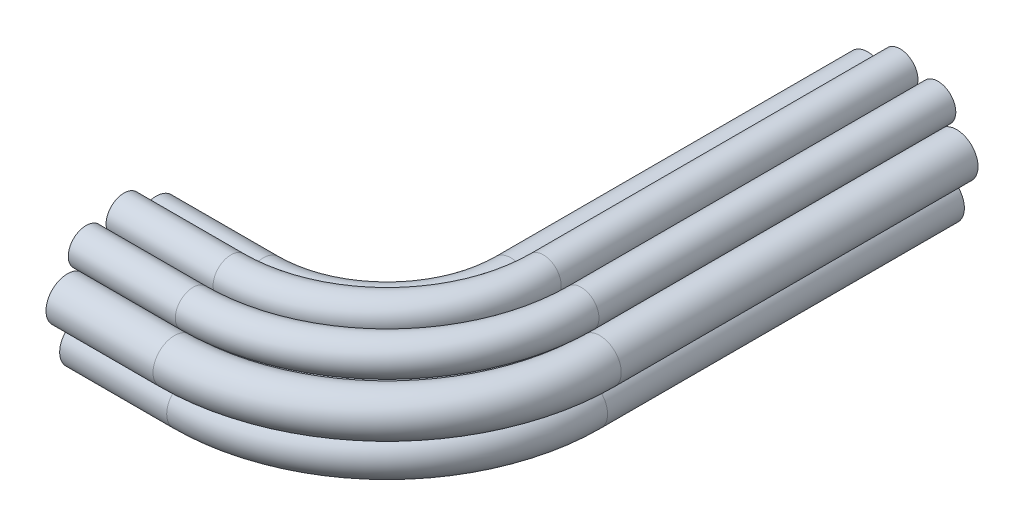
ISO-10303-21;
HEADER;
FILE_DESCRIPTION(('STEP AP214'),'2;1');
FILE_NAME('part.step','',(''),(''),'','','');
FILE_SCHEMA(('AUTOMOTIVE_DESIGN { 1 0 10303 214 1 1 1 1 }'));
ENDSEC;
DATA;
#1=APPLICATION_CONTEXT('core data for automotive mechanical design processes');
#2=APPLICATION_PROTOCOL_DEFINITION('international standard','automotive_design',2000,#1);
#3=PRODUCT_CONTEXT('',#1,'mechanical');
#4=PRODUCT('Part','Part','',(#3));
#5=PRODUCT_RELATED_PRODUCT_CATEGORY('part','',(#4));
#6=PRODUCT_DEFINITION_FORMATION('','',#4);
#7=PRODUCT_DEFINITION_CONTEXT('part definition',#1,'design');
#8=PRODUCT_DEFINITION('design','',#6,#7);
#9=PRODUCT_DEFINITION_SHAPE('','',#8);
#10=(LENGTH_UNIT() NAMED_UNIT(*) SI_UNIT(.MILLI.,.METRE.));
#11=(NAMED_UNIT(*) PLANE_ANGLE_UNIT() SI_UNIT($,.RADIAN.));
#12=(NAMED_UNIT(*) SI_UNIT($,.STERADIAN.) SOLID_ANGLE_UNIT());
#13=UNCERTAINTY_MEASURE_WITH_UNIT(LENGTH_MEASURE(1.E-05),#10,'distance_accuracy_value','');
#14=(GEOMETRIC_REPRESENTATION_CONTEXT(3) GLOBAL_UNCERTAINTY_ASSIGNED_CONTEXT((#13)) GLOBAL_UNIT_ASSIGNED_CONTEXT((#10,
#11,#12)) REPRESENTATION_CONTEXT('',''));
#15=CARTESIAN_POINT('',(0.,0.,0.));
#16=DIRECTION('',(0.,0.,1.));
#17=DIRECTION('',(1.,0.,0.));
#18=AXIS2_PLACEMENT_3D('',#15,#16,#17);
#19=CARTESIAN_POINT('',(-35.,2.56981819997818,159.613254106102));
#20=DIRECTION('',(-1.,0.,0.));
#21=DIRECTION('',(0.,0.,1.));
#22=AXIS2_PLACEMENT_3D('',#19,#20,#21);
#23=CYLINDRICAL_SURFACE('',#22,6.);
#24=CARTESIAN_POINT('',(-35.,2.56981819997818,159.613254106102));
#25=DIRECTION('',(1.,0.,0.));
#26=DIRECTION('',(0.,0.,-1.));
#27=AXIS2_PLACEMENT_3D('',#24,#25,#26);
#28=CIRCLE('',#27,6.);
#29=CARTESIAN_POINT('',(-35.,2.56981819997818,165.613254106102));
#30=VERTEX_POINT('',#29);
#31=EDGE_CURVE('P0_E20',#30,#30,#28,.T.);
#32=ORIENTED_EDGE('',*,*,#31,.F.);
#33=EDGE_LOOP('',(#32));
#34=FACE_BOUND('',#33,.T.);
#35=CARTESIAN_POINT('',(-65.,2.56981819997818,159.613254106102));
#36=DIRECTION('',(1.,0.,0.));
#37=DIRECTION('',(0.,0.,-1.));
#38=AXIS2_PLACEMENT_3D('',#35,#36,#37);
#39=CIRCLE('',#38,6.);
#40=CARTESIAN_POINT('',(-65.,2.56981819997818,153.613254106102));
#41=VERTEX_POINT('',#40);
#42=EDGE_CURVE('P0_E10',#41,#41,#39,.T.);
#43=ORIENTED_EDGE('',*,*,#42,.T.);
#44=EDGE_LOOP('',(#43));
#45=FACE_BOUND('',#44,.T.);
#46=ADVANCED_FACE('P0_F14',(#34,#45),#23,.T.);
#47=CARTESIAN_POINT('',(-35.,2.56981819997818,100.));
#48=DIRECTION('',(0.,-1.,0.));
#49=DIRECTION('',(0.,0.,-1.));
#50=AXIS2_PLACEMENT_3D('',#47,#48,#49);
#51=TOROIDAL_SURFACE('',#50,59.6132541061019,6.);
#52=CARTESIAN_POINT('',(24.6132541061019,2.56981819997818,100.));
#53=DIRECTION('',(0.,0.,-1.));
#54=DIRECTION('',(-1.,0.,0.));
#55=AXIS2_PLACEMENT_3D('',#52,#53,#54);
#56=CIRCLE('',#55,6.);
#57=CARTESIAN_POINT('',(30.6132541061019,2.56981819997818,100.));
#58=VERTEX_POINT('',#57);
#59=EDGE_CURVE('P0_E24',#58,#58,#56,.T.);
#60=CARTESIAN_POINT('',(-35.,2.56981819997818,100.));
#61=DIRECTION('',(0.,-1.,0.));
#62=DIRECTION('',(0.,0.,-1.));
#63=AXIS2_PLACEMENT_3D('',#60,#61,#62);
#64=CIRCLE('',#63,65.6132541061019);
#65=EDGE_CURVE('',#58,#30,#64,.T.);
#66=ORIENTED_EDGE('',*,*,#59,.F.);
#67=ORIENTED_EDGE('',*,*,#31,.T.);
#68=ORIENTED_EDGE('',*,*,#65,.T.);
#69=ORIENTED_EDGE('',*,*,#65,.F.);
#70=EDGE_LOOP('',(#66,#68,#67,#69));
#71=FACE_BOUND('',#70,.T.);
#72=ADVANCED_FACE('P0_F39',(#71),#51,.T.);
#73=CARTESIAN_POINT('',(24.6132541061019,2.56981819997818,100.));
#74=DIRECTION('',(0.,0.,-1.));
#75=DIRECTION('',(-1.,0.,0.));
#76=AXIS2_PLACEMENT_3D('',#73,#74,#75);
#77=CYLINDRICAL_SURFACE('',#76,6.);
#78=ORIENTED_EDGE('',*,*,#59,.T.);
#79=EDGE_LOOP('',(#78));
#80=FACE_BOUND('',#79,.T.);
#81=CARTESIAN_POINT('',(24.6132541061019,2.56981819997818,0.));
#82=DIRECTION('',(0.,0.,-1.));
#83=DIRECTION('',(-1.,0.,0.));
#84=AXIS2_PLACEMENT_3D('',#81,#82,#83);
#85=CIRCLE('',#84,6.);
#86=CARTESIAN_POINT('',(18.6132541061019,2.56981819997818,0.));
#87=VERTEX_POINT('',#86);
#88=EDGE_CURVE('P0_E28',#87,#87,#85,.T.);
#89=ORIENTED_EDGE('',*,*,#88,.F.);
#90=EDGE_LOOP('',(#89));
#91=FACE_BOUND('',#90,.T.);
#92=ADVANCED_FACE('P0_F36',(#80,#91),#77,.T.);
#93=CARTESIAN_POINT('',(-65.,2.56981819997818,159.613254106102));
#94=DIRECTION('',(1.,0.,0.));
#95=DIRECTION('',(0.,0.,-1.));
#96=AXIS2_PLACEMENT_3D('',#93,#94,#95);
#97=PLANE('',#96);
#98=ORIENTED_EDGE('',*,*,#42,.F.);
#99=EDGE_LOOP('',(#98));
#100=FACE_BOUND('',#99,.T.);
#101=ADVANCED_FACE('P0_F38',(#100),#97,.F.);
#102=CARTESIAN_POINT('',(24.6132541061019,2.56981819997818,0.));
#103=DIRECTION('',(0.,0.,-1.));
#104=DIRECTION('',(-1.,0.,0.));
#105=AXIS2_PLACEMENT_3D('',#102,#103,#104);
#106=PLANE('',#105);
#107=ORIENTED_EDGE('',*,*,#88,.T.);
#108=EDGE_LOOP('',(#107));
#109=FACE_BOUND('',#108,.T.);
#110=ADVANCED_FACE('P0_F34',(#109),#106,.T.);
#111=CLOSED_SHELL('',(#46,#72,#92,#101,#110));
#112=MANIFOLD_SOLID_BREP('P0_B1',#111);
#113=CARTESIAN_POINT('',(-35.,0.,127.508594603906));
#114=DIRECTION('',(-1.,0.,0.));
#115=DIRECTION('',(0.,0.,1.));
#116=AXIS2_PLACEMENT_3D('',#113,#114,#115);
#117=CYLINDRICAL_SURFACE('',#116,5.);
#118=CARTESIAN_POINT('',(-35.,0.,127.508594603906));
#119=DIRECTION('',(1.,0.,0.));
#120=DIRECTION('',(0.,0.,-1.));
#121=AXIS2_PLACEMENT_3D('',#118,#119,#120);
#122=CIRCLE('',#121,5.);
#123=CARTESIAN_POINT('',(-35.,0.,132.508594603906));
#124=VERTEX_POINT('',#123);
#125=EDGE_CURVE('P1_E20',#124,#124,#122,.T.);
#126=ORIENTED_EDGE('',*,*,#125,.F.);
#127=EDGE_LOOP('',(#126));
#128=FACE_BOUND('',#127,.T.);
#129=CARTESIAN_POINT('',(-65.,0.,127.508594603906));
#130=DIRECTION('',(1.,0.,0.));
#131=DIRECTION('',(0.,0.,-1.));
#132=AXIS2_PLACEMENT_3D('',#129,#130,#131);
#133=CIRCLE('',#132,5.);
#134=CARTESIAN_POINT('',(-65.,0.,122.508594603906));
#135=VERTEX_POINT('',#134);
#136=EDGE_CURVE('P1_E10',#135,#135,#133,.T.);
#137=ORIENTED_EDGE('',*,*,#136,.T.);
#138=EDGE_LOOP('',(#137));
#139=FACE_BOUND('',#138,.T.);
#140=ADVANCED_FACE('P1_F14',(#128,#139),#117,.T.);
#141=CARTESIAN_POINT('',(-35.,0.,100.));
#142=DIRECTION('',(0.,-1.,0.));
#143=DIRECTION('',(0.,0.,-1.));
#144=AXIS2_PLACEMENT_3D('',#141,#142,#143);
#145=TOROIDAL_SURFACE('',#144,27.5085946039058,5.);
#146=CARTESIAN_POINT('',(-7.49140539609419,0.,100.));
#147=DIRECTION('',(0.,0.,-1.));
#148=DIRECTION('',(-1.,0.,0.));
#149=AXIS2_PLACEMENT_3D('',#146,#147,#148);
#150=CIRCLE('',#149,5.);
#151=CARTESIAN_POINT('',(-2.49140539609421,0.,100.));
#152=VERTEX_POINT('',#151);
#153=EDGE_CURVE('P1_E24',#152,#152,#150,.T.);
#154=CARTESIAN_POINT('',(-35.,0.,100.));
#155=DIRECTION('',(0.,-1.,0.));
#156=DIRECTION('',(0.,0.,-1.));
#157=AXIS2_PLACEMENT_3D('',#154,#155,#156);
#158=CIRCLE('',#157,32.5085946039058);
#159=EDGE_CURVE('',#152,#124,#158,.T.);
#160=ORIENTED_EDGE('',*,*,#153,.F.);
#161=ORIENTED_EDGE('',*,*,#125,.T.);
#162=ORIENTED_EDGE('',*,*,#159,.T.);
#163=ORIENTED_EDGE('',*,*,#159,.F.);
#164=EDGE_LOOP('',(#160,#162,#161,#163));
#165=FACE_BOUND('',#164,.T.);
#166=ADVANCED_FACE('P1_F39',(#165),#145,.T.);
#167=CARTESIAN_POINT('',(-7.49140539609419,0.,100.));
#168=DIRECTION('',(0.,0.,-1.));
#169=DIRECTION('',(-1.,0.,0.));
#170=AXIS2_PLACEMENT_3D('',#167,#168,#169);
#171=CYLINDRICAL_SURFACE('',#170,5.);
#172=ORIENTED_EDGE('',*,*,#153,.T.);
#173=EDGE_LOOP('',(#172));
#174=FACE_BOUND('',#173,.T.);
#175=CARTESIAN_POINT('',(-7.49140539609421,0.,0.));
#176=DIRECTION('',(0.,0.,-1.));
#177=DIRECTION('',(-1.,0.,0.));
#178=AXIS2_PLACEMENT_3D('',#175,#176,#177);
#179=CIRCLE('',#178,5.);
#180=CARTESIAN_POINT('',(-12.4914053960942,0.,0.));
#181=VERTEX_POINT('',#180);
#182=EDGE_CURVE('P1_E28',#181,#181,#179,.T.);
#183=ORIENTED_EDGE('',*,*,#182,.F.);
#184=EDGE_LOOP('',(#183));
#185=FACE_BOUND('',#184,.T.);
#186=ADVANCED_FACE('P1_F36',(#174,#185),#171,.T.);
#187=CARTESIAN_POINT('',(-65.,0.,127.508594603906));
#188=DIRECTION('',(1.,0.,0.));
#189=DIRECTION('',(0.,0.,-1.));
#190=AXIS2_PLACEMENT_3D('',#187,#188,#189);
#191=PLANE('',#190);
#192=ORIENTED_EDGE('',*,*,#136,.F.);
#193=EDGE_LOOP('',(#192));
#194=FACE_BOUND('',#193,.T.);
#195=ADVANCED_FACE('P1_F38',(#194),#191,.F.);
#196=CARTESIAN_POINT('',(-7.49140539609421,0.,0.));
#197=DIRECTION('',(0.,0.,-1.));
#198=DIRECTION('',(-1.,0.,0.));
#199=AXIS2_PLACEMENT_3D('',#196,#197,#198);
#200=PLANE('',#199);
#201=ORIENTED_EDGE('',*,*,#182,.T.);
#202=EDGE_LOOP('',(#201));
#203=FACE_BOUND('',#202,.T.);
#204=ADVANCED_FACE('P1_F34',(#203),#200,.T.);
#205=CLOSED_SHELL('',(#140,#166,#186,#195,#204));
#206=MANIFOLD_SOLID_BREP('P1_B1',#205);
#207=CARTESIAN_POINT('',(-35.,8.97665881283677,134.733603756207));
#208=DIRECTION('',(-1.,0.,0.));
#209=DIRECTION('',(0.,0.,1.));
#210=AXIS2_PLACEMENT_3D('',#207,#208,#209);
#211=CYLINDRICAL_SURFACE('',#210,6.);
#212=CARTESIAN_POINT('',(-35.,8.97665881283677,134.733603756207));
#213=DIRECTION('',(1.,0.,0.));
#214=DIRECTION('',(0.,0.,-1.));
#215=AXIS2_PLACEMENT_3D('',#212,#213,#214);
#216=CIRCLE('',#215,6.);
#217=CARTESIAN_POINT('',(-35.,8.97665881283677,140.733603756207));
#218=VERTEX_POINT('',#217);
#219=EDGE_CURVE('P2_E20',#218,#218,#216,.T.);
#220=ORIENTED_EDGE('',*,*,#219,.F.);
#221=EDGE_LOOP('',(#220));
#222=FACE_BOUND('',#221,.T.);
#223=CARTESIAN_POINT('',(-65.,8.97665881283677,134.733603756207));
#224=DIRECTION('',(1.,0.,0.));
#225=DIRECTION('',(0.,0.,-1.));
#226=AXIS2_PLACEMENT_3D('',#223,#224,#225);
#227=CIRCLE('',#226,6.);
#228=CARTESIAN_POINT('',(-65.,8.97665881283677,128.733603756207));
#229=VERTEX_POINT('',#228);
#230=EDGE_CURVE('P2_E10',#229,#229,#227,.T.);
#231=ORIENTED_EDGE('',*,*,#230,.T.);
#232=EDGE_LOOP('',(#231));
#233=FACE_BOUND('',#232,.T.);
#234=ADVANCED_FACE('P2_F14',(#222,#233),#211,.T.);
#235=CARTESIAN_POINT('',(-35.,8.97665881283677,100.));
#236=DIRECTION('',(0.,-1.,0.));
#237=DIRECTION('',(0.,0.,-1.));
#238=AXIS2_PLACEMENT_3D('',#235,#236,#237);
#239=TOROIDAL_SURFACE('',#238,34.7336037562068,6.);
#240=CARTESIAN_POINT('',(-0.266396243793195,8.97665881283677,100.));
#241=DIRECTION('',(0.,0.,-1.));
#242=DIRECTION('',(-1.,0.,0.));
#243=AXIS2_PLACEMENT_3D('',#240,#241,#242);
#244=CIRCLE('',#243,6.);
#245=CARTESIAN_POINT('',(5.7336037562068,8.97665881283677,100.));
#246=VERTEX_POINT('',#245);
#247=EDGE_CURVE('P2_E24',#246,#246,#244,.T.);
#248=CARTESIAN_POINT('',(-35.,8.97665881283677,100.));
#249=DIRECTION('',(0.,-1.,0.));
#250=DIRECTION('',(0.,0.,-1.));
#251=AXIS2_PLACEMENT_3D('',#248,#249,#250);
#252=CIRCLE('',#251,40.7336037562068);
#253=EDGE_CURVE('',#246,#218,#252,.T.);
#254=ORIENTED_EDGE('',*,*,#247,.F.);
#255=ORIENTED_EDGE('',*,*,#219,.T.);
#256=ORIENTED_EDGE('',*,*,#253,.T.);
#257=ORIENTED_EDGE('',*,*,#253,.F.);
#258=EDGE_LOOP('',(#254,#256,#255,#257));
#259=FACE_BOUND('',#258,.T.);
#260=ADVANCED_FACE('P2_F39',(#259),#239,.T.);
#261=CARTESIAN_POINT('',(-0.266396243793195,8.97665881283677,100.));
#262=DIRECTION('',(0.,0.,-1.));
#263=DIRECTION('',(-1.,0.,0.));
#264=AXIS2_PLACEMENT_3D('',#261,#262,#263);
#265=CYLINDRICAL_SURFACE('',#264,6.);
#266=ORIENTED_EDGE('',*,*,#247,.T.);
#267=EDGE_LOOP('',(#266));
#268=FACE_BOUND('',#267,.T.);
#269=CARTESIAN_POINT('',(-0.266396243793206,8.97665881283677,0.));
#270=DIRECTION('',(0.,0.,-1.));
#271=DIRECTION('',(-1.,0.,0.));
#272=AXIS2_PLACEMENT_3D('',#269,#270,#271);
#273=CIRCLE('',#272,6.);
#274=CARTESIAN_POINT('',(-6.26639624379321,8.97665881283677,0.));
#275=VERTEX_POINT('',#274);
#276=EDGE_CURVE('P2_E28',#275,#275,#273,.T.);
#277=ORIENTED_EDGE('',*,*,#276,.F.);
#278=EDGE_LOOP('',(#277));
#279=FACE_BOUND('',#278,.T.);
#280=ADVANCED_FACE('P2_F36',(#268,#279),#265,.T.);
#281=CARTESIAN_POINT('',(-65.,8.97665881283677,134.733603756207));
#282=DIRECTION('',(1.,0.,0.));
#283=DIRECTION('',(0.,0.,-1.));
#284=AXIS2_PLACEMENT_3D('',#281,#282,#283);
#285=PLANE('',#284);
#286=ORIENTED_EDGE('',*,*,#230,.F.);
#287=EDGE_LOOP('',(#286));
#288=FACE_BOUND('',#287,.T.);
#289=ADVANCED_FACE('P2_F38',(#288),#285,.F.);
#290=CARTESIAN_POINT('',(-0.266396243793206,8.97665881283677,0.));
#291=DIRECTION('',(0.,0.,-1.));
#292=DIRECTION('',(-1.,0.,0.));
#293=AXIS2_PLACEMENT_3D('',#290,#291,#292);
#294=PLANE('',#293);
#295=ORIENTED_EDGE('',*,*,#276,.T.);
#296=EDGE_LOOP('',(#295));
#297=FACE_BOUND('',#296,.T.);
#298=ADVANCED_FACE('P2_F34',(#297),#294,.T.);
#299=CLOSED_SHELL('',(#234,#260,#280,#289,#298));
#300=MANIFOLD_SOLID_BREP('P2_B1',#299);
#301=CARTESIAN_POINT('',(-35.,-9.41560890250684,135.785203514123));
#302=DIRECTION('',(-1.,0.,0.));
#303=DIRECTION('',(0.,0.,1.));
#304=AXIS2_PLACEMENT_3D('',#301,#302,#303);
#305=CYLINDRICAL_SURFACE('',#304,6.);
#306=CARTESIAN_POINT('',(-35.,-9.41560890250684,135.785203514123));
#307=DIRECTION('',(1.,0.,0.));
#308=DIRECTION('',(0.,0.,-1.));
#309=AXIS2_PLACEMENT_3D('',#306,#307,#308);
#310=CIRCLE('',#309,6.);
#311=CARTESIAN_POINT('',(-35.,-9.41560890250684,141.785203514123));
#312=VERTEX_POINT('',#311);
#313=EDGE_CURVE('P3_E20',#312,#312,#310,.T.);
#314=ORIENTED_EDGE('',*,*,#313,.F.);
#315=EDGE_LOOP('',(#314));
#316=FACE_BOUND('',#315,.T.);
#317=CARTESIAN_POINT('',(-65.,-9.41560890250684,135.785203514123));
#318=DIRECTION('',(1.,0.,0.));
#319=DIRECTION('',(0.,0.,-1.));
#320=AXIS2_PLACEMENT_3D('',#317,#318,#319);
#321=CIRCLE('',#320,6.);
#322=CARTESIAN_POINT('',(-65.,-9.41560890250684,129.785203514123));
#323=VERTEX_POINT('',#322);
#324=EDGE_CURVE('P3_E10',#323,#323,#321,.T.);
#325=ORIENTED_EDGE('',*,*,#324,.T.);
#326=EDGE_LOOP('',(#325));
#327=FACE_BOUND('',#326,.T.);
#328=ADVANCED_FACE('P3_F14',(#316,#327),#305,.T.);
#329=CARTESIAN_POINT('',(-35.,-9.41560890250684,100.));
#330=DIRECTION('',(0.,-1.,0.));
#331=DIRECTION('',(0.,0.,-1.));
#332=AXIS2_PLACEMENT_3D('',#329,#330,#331);
#333=TOROIDAL_SURFACE('',#332,35.7852035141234,6.);
#334=CARTESIAN_POINT('',(0.785203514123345,-9.41560890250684,100.));
#335=DIRECTION('',(0.,0.,-1.));
#336=DIRECTION('',(-1.,0.,0.));
#337=AXIS2_PLACEMENT_3D('',#334,#335,#336);
#338=CIRCLE('',#337,6.);
#339=CARTESIAN_POINT('',(6.78520351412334,-9.41560890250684,100.));
#340=VERTEX_POINT('',#339);
#341=EDGE_CURVE('P3_E24',#340,#340,#338,.T.);
#342=CARTESIAN_POINT('',(-35.,-9.41560890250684,100.));
#343=DIRECTION('',(0.,-1.,0.));
#344=DIRECTION('',(0.,0.,-1.));
#345=AXIS2_PLACEMENT_3D('',#342,#343,#344);
#346=CIRCLE('',#345,41.7852035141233);
#347=EDGE_CURVE('',#340,#312,#346,.T.);
#348=ORIENTED_EDGE('',*,*,#341,.F.);
#349=ORIENTED_EDGE('',*,*,#313,.T.);
#350=ORIENTED_EDGE('',*,*,#347,.T.);
#351=ORIENTED_EDGE('',*,*,#347,.F.);
#352=EDGE_LOOP('',(#348,#350,#349,#351));
#353=FACE_BOUND('',#352,.T.);
#354=ADVANCED_FACE('P3_F39',(#353),#333,.T.);
#355=CARTESIAN_POINT('',(0.785203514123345,-9.41560890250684,100.));
#356=DIRECTION('',(0.,0.,-1.));
#357=DIRECTION('',(-1.,0.,0.));
#358=AXIS2_PLACEMENT_3D('',#355,#356,#357);
#359=CYLINDRICAL_SURFACE('',#358,6.);
#360=ORIENTED_EDGE('',*,*,#341,.T.);
#361=EDGE_LOOP('',(#360));
#362=FACE_BOUND('',#361,.T.);
#363=CARTESIAN_POINT('',(0.785203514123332,-9.41560890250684,0.));
#364=DIRECTION('',(0.,0.,-1.));
#365=DIRECTION('',(-1.,0.,0.));
#366=AXIS2_PLACEMENT_3D('',#363,#364,#365);
#367=CIRCLE('',#366,6.);
#368=CARTESIAN_POINT('',(-5.21479648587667,-9.41560890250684,0.));
#369=VERTEX_POINT('',#368);
#370=EDGE_CURVE('P3_E28',#369,#369,#367,.T.);
#371=ORIENTED_EDGE('',*,*,#370,.F.);
#372=EDGE_LOOP('',(#371));
#373=FACE_BOUND('',#372,.T.);
#374=ADVANCED_FACE('P3_F36',(#362,#373),#359,.T.);
#375=CARTESIAN_POINT('',(-65.,-9.41560890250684,135.785203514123));
#376=DIRECTION('',(1.,0.,0.));
#377=DIRECTION('',(0.,0.,-1.));
#378=AXIS2_PLACEMENT_3D('',#375,#376,#377);
#379=PLANE('',#378);
#380=ORIENTED_EDGE('',*,*,#324,.F.);
#381=EDGE_LOOP('',(#380));
#382=FACE_BOUND('',#381,.T.);
#383=ADVANCED_FACE('P3_F38',(#382),#379,.F.);
#384=CARTESIAN_POINT('',(0.785203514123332,-9.41560890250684,0.));
#385=DIRECTION('',(0.,0.,-1.));
#386=DIRECTION('',(-1.,0.,0.));
#387=AXIS2_PLACEMENT_3D('',#384,#385,#386);
#388=PLANE('',#387);
#389=ORIENTED_EDGE('',*,*,#370,.T.);
#390=EDGE_LOOP('',(#389));
#391=FACE_BOUND('',#390,.T.);
#392=ADVANCED_FACE('P3_F34',(#391),#388,.T.);
#393=CLOSED_SHELL('',(#328,#354,#374,#383,#392));
#394=MANIFOLD_SOLID_BREP('P3_B1',#393);
#395=CARTESIAN_POINT('',(-35.,-9.41560890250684,155.785203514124));
#396=DIRECTION('',(-1.,0.,0.));
#397=DIRECTION('',(0.,0.,1.));
#398=AXIS2_PLACEMENT_3D('',#395,#396,#397);
#399=CYLINDRICAL_SURFACE('',#398,6.);
#400=CARTESIAN_POINT('',(-35.,-9.41560890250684,155.785203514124));
#401=DIRECTION('',(1.,0.,0.));
#402=DIRECTION('',(0.,0.,-1.));
#403=AXIS2_PLACEMENT_3D('',#400,#401,#402);
#404=CIRCLE('',#403,6.);
#405=CARTESIAN_POINT('',(-35.,-9.41560890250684,161.785203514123));
#406=VERTEX_POINT('',#405);
#407=EDGE_CURVE('P4_E20',#406,#406,#404,.T.);
#408=ORIENTED_EDGE('',*,*,#407,.F.);
#409=EDGE_LOOP('',(#408));
#410=FACE_BOUND('',#409,.T.);
#411=CARTESIAN_POINT('',(-65.,-9.41560890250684,155.785203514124));
#412=DIRECTION('',(1.,0.,0.));
#413=DIRECTION('',(0.,0.,-1.));
#414=AXIS2_PLACEMENT_3D('',#411,#412,#413);
#415=CIRCLE('',#414,6.);
#416=CARTESIAN_POINT('',(-65.,-9.41560890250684,149.785203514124));
#417=VERTEX_POINT('',#416);
#418=EDGE_CURVE('P4_E10',#417,#417,#415,.T.);
#419=ORIENTED_EDGE('',*,*,#418,.T.);
#420=EDGE_LOOP('',(#419));
#421=FACE_BOUND('',#420,.T.);
#422=ADVANCED_FACE('P4_F14',(#410,#421),#399,.T.);
#423=CARTESIAN_POINT('',(-35.,-9.41560890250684,100.));
#424=DIRECTION('',(0.,-1.,0.));
#425=DIRECTION('',(0.,0.,-1.));
#426=AXIS2_PLACEMENT_3D('',#423,#424,#425);
#427=TOROIDAL_SURFACE('',#426,55.7852035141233,6.);
#428=CARTESIAN_POINT('',(20.7852035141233,-9.41560890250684,100.));
#429=DIRECTION('',(0.,0.,-1.));
#430=DIRECTION('',(-1.,0.,0.));
#431=AXIS2_PLACEMENT_3D('',#428,#429,#430);
#432=CIRCLE('',#431,6.);
#433=CARTESIAN_POINT('',(26.7852035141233,-9.41560890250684,100.));
#434=VERTEX_POINT('',#433);
#435=EDGE_CURVE('P4_E24',#434,#434,#432,.T.);
#436=CARTESIAN_POINT('',(-35.,-9.41560890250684,100.));
#437=DIRECTION('',(0.,-1.,0.));
#438=DIRECTION('',(0.,0.,-1.));
#439=AXIS2_PLACEMENT_3D('',#436,#437,#438);
#440=CIRCLE('',#439,61.7852035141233);
#441=EDGE_CURVE('',#434,#406,#440,.T.);
#442=ORIENTED_EDGE('',*,*,#435,.F.);
#443=ORIENTED_EDGE('',*,*,#407,.T.);
#444=ORIENTED_EDGE('',*,*,#441,.T.);
#445=ORIENTED_EDGE('',*,*,#441,.F.);
#446=EDGE_LOOP('',(#442,#444,#443,#445));
#447=FACE_BOUND('',#446,.T.);
#448=ADVANCED_FACE('P4_F39',(#447),#427,.T.);
#449=CARTESIAN_POINT('',(20.7852035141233,-9.41560890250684,100.));
#450=DIRECTION('',(0.,0.,-1.));
#451=DIRECTION('',(-1.,0.,0.));
#452=AXIS2_PLACEMENT_3D('',#449,#450,#451);
#453=CYLINDRICAL_SURFACE('',#452,6.);
#454=ORIENTED_EDGE('',*,*,#435,.T.);
#455=EDGE_LOOP('',(#454));
#456=FACE_BOUND('',#455,.T.);
#457=CARTESIAN_POINT('',(20.7852035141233,-9.41560890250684,0.));
#458=DIRECTION('',(0.,0.,-1.));
#459=DIRECTION('',(-1.,0.,0.));
#460=AXIS2_PLACEMENT_3D('',#457,#458,#459);
#461=CIRCLE('',#460,6.);
#462=CARTESIAN_POINT('',(14.7852035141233,-9.41560890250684,0.));
#463=VERTEX_POINT('',#462);
#464=EDGE_CURVE('P4_E28',#463,#463,#461,.T.);
#465=ORIENTED_EDGE('',*,*,#464,.F.);
#466=EDGE_LOOP('',(#465));
#467=FACE_BOUND('',#466,.T.);
#468=ADVANCED_FACE('P4_F36',(#456,#467),#453,.T.);
#469=CARTESIAN_POINT('',(-65.,-9.41560890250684,155.785203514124));
#470=DIRECTION('',(1.,0.,0.));
#471=DIRECTION('',(0.,0.,-1.));
#472=AXIS2_PLACEMENT_3D('',#469,#470,#471);
#473=PLANE('',#472);
#474=ORIENTED_EDGE('',*,*,#418,.F.);
#475=EDGE_LOOP('',(#474));
#476=FACE_BOUND('',#475,.T.);
#477=ADVANCED_FACE('P4_F38',(#476),#473,.F.);
#478=CARTESIAN_POINT('',(20.7852035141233,-9.41560890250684,0.));
#479=DIRECTION('',(0.,0.,-1.));
#480=DIRECTION('',(-1.,0.,0.));
#481=AXIS2_PLACEMENT_3D('',#478,#479,#480);
#482=PLANE('',#481);
#483=ORIENTED_EDGE('',*,*,#464,.T.);
#484=EDGE_LOOP('',(#483));
#485=FACE_BOUND('',#484,.T.);
#486=ADVANCED_FACE('P4_F34',(#485),#482,.T.);
#487=CLOSED_SHELL('',(#422,#448,#468,#477,#486));
#488=MANIFOLD_SOLID_BREP('P4_B1',#487);
#489=CARTESIAN_POINT('',(-35.,15.2473457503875,143.77724350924));
#490=DIRECTION('',(-1.,0.,0.));
#491=DIRECTION('',(0.,0.,1.));
#492=AXIS2_PLACEMENT_3D('',#489,#490,#491);
#493=CYLINDRICAL_SURFACE('',#492,5.);
#494=CARTESIAN_POINT('',(-35.,15.2473457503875,143.77724350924));
#495=DIRECTION('',(1.,0.,0.));
#496=DIRECTION('',(0.,0.,-1.));
#497=AXIS2_PLACEMENT_3D('',#494,#495,#496);
#498=CIRCLE('',#497,5.);
#499=CARTESIAN_POINT('',(-35.,15.2473457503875,148.77724350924));
#500=VERTEX_POINT('',#499);
#501=EDGE_CURVE('P5_E20',#500,#500,#498,.T.);
#502=ORIENTED_EDGE('',*,*,#501,.F.);
#503=EDGE_LOOP('',(#502));
#504=FACE_BOUND('',#503,.T.);
#505=CARTESIAN_POINT('',(-65.,15.2473457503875,143.77724350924));
#506=DIRECTION('',(1.,0.,0.));
#507=DIRECTION('',(0.,0.,-1.));
#508=AXIS2_PLACEMENT_3D('',#505,#506,#507);
#509=CIRCLE('',#508,5.);
#510=CARTESIAN_POINT('',(-65.,15.2473457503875,138.77724350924));
#511=VERTEX_POINT('',#510);
#512=EDGE_CURVE('P5_E10',#511,#511,#509,.T.);
#513=ORIENTED_EDGE('',*,*,#512,.T.);
#514=EDGE_LOOP('',(#513));
#515=FACE_BOUND('',#514,.T.);
#516=ADVANCED_FACE('P5_F14',(#504,#515),#493,.T.);
#517=CARTESIAN_POINT('',(-35.,15.2473457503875,100.));
#518=DIRECTION('',(0.,-1.,0.));
#519=DIRECTION('',(0.,0.,-1.));
#520=AXIS2_PLACEMENT_3D('',#517,#518,#519);
#521=TOROIDAL_SURFACE('',#520,43.7772435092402,5.);
#522=CARTESIAN_POINT('',(8.77724350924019,15.2473457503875,100.));
#523=DIRECTION('',(0.,0.,-1.));
#524=DIRECTION('',(-1.,0.,0.));
#525=AXIS2_PLACEMENT_3D('',#522,#523,#524);
#526=CIRCLE('',#525,5.);
#527=CARTESIAN_POINT('',(13.7772435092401,15.2473457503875,100.));
#528=VERTEX_POINT('',#527);
#529=EDGE_CURVE('P5_E24',#528,#528,#526,.T.);
#530=CARTESIAN_POINT('',(-35.,15.2473457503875,100.));
#531=DIRECTION('',(0.,-1.,0.));
#532=DIRECTION('',(0.,0.,-1.));
#533=AXIS2_PLACEMENT_3D('',#530,#531,#532);
#534=CIRCLE('',#533,48.7772435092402);
#535=EDGE_CURVE('',#528,#500,#534,.T.);
#536=ORIENTED_EDGE('',*,*,#529,.F.);
#537=ORIENTED_EDGE('',*,*,#501,.T.);
#538=ORIENTED_EDGE('',*,*,#535,.T.);
#539=ORIENTED_EDGE('',*,*,#535,.F.);
#540=EDGE_LOOP('',(#536,#538,#537,#539));
#541=FACE_BOUND('',#540,.T.);
#542=ADVANCED_FACE('P5_F39',(#541),#521,.T.);
#543=CARTESIAN_POINT('',(8.77724350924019,15.2473457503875,100.));
#544=DIRECTION('',(0.,0.,-1.));
#545=DIRECTION('',(-1.,0.,0.));
#546=AXIS2_PLACEMENT_3D('',#543,#544,#545);
#547=CYLINDRICAL_SURFACE('',#546,5.);
#548=ORIENTED_EDGE('',*,*,#529,.T.);
#549=EDGE_LOOP('',(#548));
#550=FACE_BOUND('',#549,.T.);
#551=CARTESIAN_POINT('',(8.77724350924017,15.2473457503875,0.));
#552=DIRECTION('',(0.,0.,-1.));
#553=DIRECTION('',(-1.,0.,0.));
#554=AXIS2_PLACEMENT_3D('',#551,#552,#553);
#555=CIRCLE('',#554,5.);
#556=CARTESIAN_POINT('',(3.77724350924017,15.2473457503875,0.));
#557=VERTEX_POINT('',#556);
#558=EDGE_CURVE('P5_E28',#557,#557,#555,.T.);
#559=ORIENTED_EDGE('',*,*,#558,.F.);
#560=EDGE_LOOP('',(#559));
#561=FACE_BOUND('',#560,.T.);
#562=ADVANCED_FACE('P5_F36',(#550,#561),#547,.T.);
#563=CARTESIAN_POINT('',(-65.,15.2473457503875,143.77724350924));
#564=DIRECTION('',(1.,0.,0.));
#565=DIRECTION('',(0.,0.,-1.));
#566=AXIS2_PLACEMENT_3D('',#563,#564,#565);
#567=PLANE('',#566);
#568=ORIENTED_EDGE('',*,*,#512,.F.);
#569=EDGE_LOOP('',(#568));
#570=FACE_BOUND('',#569,.T.);
#571=ADVANCED_FACE('P5_F38',(#570),#567,.F.);
#572=CARTESIAN_POINT('',(8.77724350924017,15.2473457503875,0.));
#573=DIRECTION('',(0.,0.,-1.));
#574=DIRECTION('',(-1.,0.,0.));
#575=AXIS2_PLACEMENT_3D('',#572,#573,#574);
#576=PLANE('',#575);
#577=ORIENTED_EDGE('',*,*,#558,.T.);
#578=EDGE_LOOP('',(#577));
#579=FACE_BOUND('',#578,.T.);
#580=ADVANCED_FACE('P5_F34',(#579),#576,.T.);
#581=CLOSED_SHELL('',(#516,#542,#562,#571,#580));
#582=MANIFOLD_SOLID_BREP('P5_B1',#581);
#583=CARTESIAN_POINT('',(-35.,0.382350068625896,145.785203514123));
#584=DIRECTION('',(-1.,0.,0.));
#585=DIRECTION('',(0.,0.,1.));
#586=AXIS2_PLACEMENT_3D('',#583,#584,#585);
#587=CYLINDRICAL_SURFACE('',#586,5.);
#588=CARTESIAN_POINT('',(-35.,0.382350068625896,145.785203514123));
#589=DIRECTION('',(1.,0.,0.));
#590=DIRECTION('',(0.,0.,-1.));
#591=AXIS2_PLACEMENT_3D('',#588,#589,#590);
#592=CIRCLE('',#591,5.);
#593=CARTESIAN_POINT('',(-35.,0.382350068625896,150.785203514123));
#594=VERTEX_POINT('',#593);
#595=EDGE_CURVE('P6_E20',#594,#594,#592,.T.);
#596=ORIENTED_EDGE('',*,*,#595,.F.);
#597=EDGE_LOOP('',(#596));
#598=FACE_BOUND('',#597,.T.);
#599=CARTESIAN_POINT('',(-65.,0.382350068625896,145.785203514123));
#600=DIRECTION('',(1.,0.,0.));
#601=DIRECTION('',(0.,0.,-1.));
#602=AXIS2_PLACEMENT_3D('',#599,#600,#601);
#603=CIRCLE('',#602,5.);
#604=CARTESIAN_POINT('',(-65.,0.382350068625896,140.785203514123));
#605=VERTEX_POINT('',#604);
#606=EDGE_CURVE('P6_E10',#605,#605,#603,.T.);
#607=ORIENTED_EDGE('',*,*,#606,.T.);
#608=EDGE_LOOP('',(#607));
#609=FACE_BOUND('',#608,.T.);
#610=ADVANCED_FACE('P6_F14',(#598,#609),#587,.T.);
#611=CARTESIAN_POINT('',(-35.,0.382350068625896,100.));
#612=DIRECTION('',(0.,-1.,0.));
#613=DIRECTION('',(0.,0.,-1.));
#614=AXIS2_PLACEMENT_3D('',#611,#612,#613);
#615=TOROIDAL_SURFACE('',#614,45.7852035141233,5.);
#616=CARTESIAN_POINT('',(10.7852035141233,0.382350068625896,100.));
#617=DIRECTION('',(0.,0.,-1.));
#618=DIRECTION('',(-1.,0.,0.));
#619=AXIS2_PLACEMENT_3D('',#616,#617,#618);
#620=CIRCLE('',#619,5.);
#621=CARTESIAN_POINT('',(15.7852035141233,0.382350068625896,100.));
#622=VERTEX_POINT('',#621);
#623=EDGE_CURVE('P6_E24',#622,#622,#620,.T.);
#624=CARTESIAN_POINT('',(-35.,0.382350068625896,100.));
#625=DIRECTION('',(0.,-1.,0.));
#626=DIRECTION('',(0.,0.,-1.));
#627=AXIS2_PLACEMENT_3D('',#624,#625,#626);
#628=CIRCLE('',#627,50.7852035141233);
#629=EDGE_CURVE('',#622,#594,#628,.T.);
#630=ORIENTED_EDGE('',*,*,#623,.F.);
#631=ORIENTED_EDGE('',*,*,#595,.T.);
#632=ORIENTED_EDGE('',*,*,#629,.T.);
#633=ORIENTED_EDGE('',*,*,#629,.F.);
#634=EDGE_LOOP('',(#630,#632,#631,#633));
#635=FACE_BOUND('',#634,.T.);
#636=ADVANCED_FACE('P6_F39',(#635),#615,.T.);
#637=CARTESIAN_POINT('',(10.7852035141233,0.382350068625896,100.));
#638=DIRECTION('',(0.,0.,-1.));
#639=DIRECTION('',(-1.,0.,0.));
#640=AXIS2_PLACEMENT_3D('',#637,#638,#639);
#641=CYLINDRICAL_SURFACE('',#640,5.);
#642=ORIENTED_EDGE('',*,*,#623,.T.);
#643=EDGE_LOOP('',(#642));
#644=FACE_BOUND('',#643,.T.);
#645=CARTESIAN_POINT('',(10.7852035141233,0.382350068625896,0.));
#646=DIRECTION('',(0.,0.,-1.));
#647=DIRECTION('',(-1.,0.,0.));
#648=AXIS2_PLACEMENT_3D('',#645,#646,#647);
#649=CIRCLE('',#648,5.);
#650=CARTESIAN_POINT('',(5.78520351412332,0.382350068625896,0.));
#651=VERTEX_POINT('',#650);
#652=EDGE_CURVE('P6_E28',#651,#651,#649,.T.);
#653=ORIENTED_EDGE('',*,*,#652,.F.);
#654=EDGE_LOOP('',(#653));
#655=FACE_BOUND('',#654,.T.);
#656=ADVANCED_FACE('P6_F36',(#644,#655),#641,.T.);
#657=CARTESIAN_POINT('',(-65.,0.382350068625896,145.785203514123));
#658=DIRECTION('',(1.,0.,0.));
#659=DIRECTION('',(0.,0.,-1.));
#660=AXIS2_PLACEMENT_3D('',#657,#658,#659);
#661=PLANE('',#660);
#662=ORIENTED_EDGE('',*,*,#606,.F.);
#663=EDGE_LOOP('',(#662));
#664=FACE_BOUND('',#663,.T.);
#665=ADVANCED_FACE('P6_F38',(#664),#661,.F.);
#666=CARTESIAN_POINT('',(10.7852035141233,0.382350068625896,0.));
#667=DIRECTION('',(0.,0.,-1.));
#668=DIRECTION('',(-1.,0.,0.));
#669=AXIS2_PLACEMENT_3D('',#666,#667,#668);
#670=PLANE('',#669);
#671=ORIENTED_EDGE('',*,*,#652,.T.);
#672=EDGE_LOOP('',(#671));
#673=FACE_BOUND('',#672,.T.);
#674=ADVANCED_FACE('P6_F34',(#673),#670,.T.);
#675=CLOSED_SHELL('',(#610,#636,#656,#665,#674));
#676=MANIFOLD_SOLID_BREP('P6_B1',#675);
#677=CARTESIAN_POINT('',(-35.,-14.616897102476,145.634922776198));
#678=DIRECTION('',(-1.,0.,0.));
#679=DIRECTION('',(0.,0.,1.));
#680=AXIS2_PLACEMENT_3D('',#677,#678,#679);
#681=CYLINDRICAL_SURFACE('',#680,5.);
#682=CARTESIAN_POINT('',(-35.,-14.616897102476,145.634922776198));
#683=DIRECTION('',(1.,0.,0.));
#684=DIRECTION('',(0.,0.,-1.));
#685=AXIS2_PLACEMENT_3D('',#682,#683,#684);
#686=CIRCLE('',#685,5.);
#687=CARTESIAN_POINT('',(-35.,-14.616897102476,150.634922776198));
#688=VERTEX_POINT('',#687);
#689=EDGE_CURVE('P7_E20',#688,#688,#686,.T.);
#690=ORIENTED_EDGE('',*,*,#689,.F.);
#691=EDGE_LOOP('',(#690));
#692=FACE_BOUND('',#691,.T.);
#693=CARTESIAN_POINT('',(-65.,-14.616897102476,145.634922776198));
#694=DIRECTION('',(1.,0.,0.));
#695=DIRECTION('',(0.,0.,-1.));
#696=AXIS2_PLACEMENT_3D('',#693,#694,#695);
#697=CIRCLE('',#696,5.);
#698=CARTESIAN_POINT('',(-65.,-14.616897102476,140.634922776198));
#699=VERTEX_POINT('',#698);
#700=EDGE_CURVE('P7_E10',#699,#699,#697,.T.);
#701=ORIENTED_EDGE('',*,*,#700,.T.);
#702=EDGE_LOOP('',(#701));
#703=FACE_BOUND('',#702,.T.);
#704=ADVANCED_FACE('P7_F14',(#692,#703),#681,.T.);
#705=CARTESIAN_POINT('',(-35.,-14.616897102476,100.));
#706=DIRECTION('',(0.,-1.,0.));
#707=DIRECTION('',(0.,0.,-1.));
#708=AXIS2_PLACEMENT_3D('',#705,#706,#707);
#709=TOROIDAL_SURFACE('',#708,45.6349227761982,5.);
#710=CARTESIAN_POINT('',(10.6349227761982,-14.616897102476,100.));
#711=DIRECTION('',(0.,0.,-1.));
#712=DIRECTION('',(-1.,0.,0.));
#713=AXIS2_PLACEMENT_3D('',#710,#711,#712);
#714=CIRCLE('',#713,5.);
#715=CARTESIAN_POINT('',(15.6349227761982,-14.616897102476,100.));
#716=VERTEX_POINT('',#715);
#717=EDGE_CURVE('P7_E24',#716,#716,#714,.T.);
#718=CARTESIAN_POINT('',(-35.,-14.616897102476,100.));
#719=DIRECTION('',(0.,-1.,0.));
#720=DIRECTION('',(0.,0.,-1.));
#721=AXIS2_PLACEMENT_3D('',#718,#719,#720);
#722=CIRCLE('',#721,50.6349227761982);
#723=EDGE_CURVE('',#716,#688,#722,.T.);
#724=ORIENTED_EDGE('',*,*,#717,.F.);
#725=ORIENTED_EDGE('',*,*,#689,.T.);
#726=ORIENTED_EDGE('',*,*,#723,.T.);
#727=ORIENTED_EDGE('',*,*,#723,.F.);
#728=EDGE_LOOP('',(#724,#726,#725,#727));
#729=FACE_BOUND('',#728,.T.);
#730=ADVANCED_FACE('P7_F39',(#729),#709,.T.);
#731=CARTESIAN_POINT('',(10.6349227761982,-14.616897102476,100.));
#732=DIRECTION('',(0.,0.,-1.));
#733=DIRECTION('',(-1.,0.,0.));
#734=AXIS2_PLACEMENT_3D('',#731,#732,#733);
#735=CYLINDRICAL_SURFACE('',#734,5.);
#736=ORIENTED_EDGE('',*,*,#717,.T.);
#737=EDGE_LOOP('',(#736));
#738=FACE_BOUND('',#737,.T.);
#739=CARTESIAN_POINT('',(10.6349227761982,-14.616897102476,0.));
#740=DIRECTION('',(0.,0.,-1.));
#741=DIRECTION('',(-1.,0.,0.));
#742=AXIS2_PLACEMENT_3D('',#739,#740,#741);
#743=CIRCLE('',#742,5.);
#744=CARTESIAN_POINT('',(5.6349227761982,-14.616897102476,0.));
#745=VERTEX_POINT('',#744);
#746=EDGE_CURVE('P7_E28',#745,#745,#743,.T.);
#747=ORIENTED_EDGE('',*,*,#746,.F.);
#748=EDGE_LOOP('',(#747));
#749=FACE_BOUND('',#748,.T.);
#750=ADVANCED_FACE('P7_F36',(#738,#749),#735,.T.);
#751=CARTESIAN_POINT('',(-65.,-14.616897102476,145.634922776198));
#752=DIRECTION('',(1.,0.,0.));
#753=DIRECTION('',(0.,0.,-1.));
#754=AXIS2_PLACEMENT_3D('',#751,#752,#753);
#755=PLANE('',#754);
#756=ORIENTED_EDGE('',*,*,#700,.F.);
#757=EDGE_LOOP('',(#756));
#758=FACE_BOUND('',#757,.T.);
#759=ADVANCED_FACE('P7_F38',(#758),#755,.F.);
#760=CARTESIAN_POINT('',(10.6349227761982,-14.616897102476,0.));
#761=DIRECTION('',(0.,0.,-1.));
#762=DIRECTION('',(-1.,0.,0.));
#763=AXIS2_PLACEMENT_3D('',#760,#761,#762);
#764=PLANE('',#763);
#765=ORIENTED_EDGE('',*,*,#746,.T.);
#766=EDGE_LOOP('',(#765));
#767=FACE_BOUND('',#766,.T.);
#768=ADVANCED_FACE('P7_F34',(#767),#764,.T.);
#769=CLOSED_SHELL('',(#704,#730,#750,#759,#768));
#770=MANIFOLD_SOLID_BREP('P7_B1',#769);
#771=CARTESIAN_POINT('',(-35.,12.6789585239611,154.37551319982));
#772=DIRECTION('',(-1.,0.,0.));
#773=DIRECTION('',(0.,0.,1.));
#774=AXIS2_PLACEMENT_3D('',#771,#772,#773);
#775=CYLINDRICAL_SURFACE('',#774,5.);
#776=CARTESIAN_POINT('',(-35.,12.6789585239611,154.37551319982));
#777=DIRECTION('',(1.,0.,0.));
#778=DIRECTION('',(0.,0.,-1.));
#779=AXIS2_PLACEMENT_3D('',#776,#777,#778);
#780=CIRCLE('',#779,5.);
#781=CARTESIAN_POINT('',(-35.,12.6789585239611,159.37551319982));
#782=VERTEX_POINT('',#781);
#783=EDGE_CURVE('P8_E20',#782,#782,#780,.T.);
#784=ORIENTED_EDGE('',*,*,#783,.F.);
#785=EDGE_LOOP('',(#784));
#786=FACE_BOUND('',#785,.T.);
#787=CARTESIAN_POINT('',(-65.,12.6789585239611,154.37551319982));
#788=DIRECTION('',(1.,0.,0.));
#789=DIRECTION('',(0.,0.,-1.));
#790=AXIS2_PLACEMENT_3D('',#787,#788,#789);
#791=CIRCLE('',#790,5.);
#792=CARTESIAN_POINT('',(-65.,12.6789585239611,149.37551319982));
#793=VERTEX_POINT('',#792);
#794=EDGE_CURVE('P8_E10',#793,#793,#791,.T.);
#795=ORIENTED_EDGE('',*,*,#794,.T.);
#796=EDGE_LOOP('',(#795));
#797=FACE_BOUND('',#796,.T.);
#798=ADVANCED_FACE('P8_F14',(#786,#797),#775,.T.);
#799=CARTESIAN_POINT('',(-35.,12.6789585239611,100.));
#800=DIRECTION('',(0.,-1.,0.));
#801=DIRECTION('',(0.,0.,-1.));
#802=AXIS2_PLACEMENT_3D('',#799,#800,#801);
#803=TOROIDAL_SURFACE('',#802,54.3755131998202,5.);
#804=CARTESIAN_POINT('',(19.3755131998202,12.6789585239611,100.));
#805=DIRECTION('',(0.,0.,-1.));
#806=DIRECTION('',(-1.,0.,0.));
#807=AXIS2_PLACEMENT_3D('',#804,#805,#806);
#808=CIRCLE('',#807,5.);
#809=CARTESIAN_POINT('',(24.3755131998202,12.6789585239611,100.));
#810=VERTEX_POINT('',#809);
#811=EDGE_CURVE('P8_E24',#810,#810,#808,.T.);
#812=CARTESIAN_POINT('',(-35.,12.6789585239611,100.));
#813=DIRECTION('',(0.,-1.,0.));
#814=DIRECTION('',(0.,0.,-1.));
#815=AXIS2_PLACEMENT_3D('',#812,#813,#814);
#816=CIRCLE('',#815,59.3755131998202);
#817=EDGE_CURVE('',#810,#782,#816,.T.);
#818=ORIENTED_EDGE('',*,*,#811,.F.);
#819=ORIENTED_EDGE('',*,*,#783,.T.);
#820=ORIENTED_EDGE('',*,*,#817,.T.);
#821=ORIENTED_EDGE('',*,*,#817,.F.);
#822=EDGE_LOOP('',(#818,#820,#819,#821));
#823=FACE_BOUND('',#822,.T.);
#824=ADVANCED_FACE('P8_F39',(#823),#803,.T.);
#825=CARTESIAN_POINT('',(19.3755131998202,12.6789585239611,100.));
#826=DIRECTION('',(0.,0.,-1.));
#827=DIRECTION('',(-1.,0.,0.));
#828=AXIS2_PLACEMENT_3D('',#825,#826,#827);
#829=CYLINDRICAL_SURFACE('',#828,5.);
#830=ORIENTED_EDGE('',*,*,#811,.T.);
#831=EDGE_LOOP('',(#830));
#832=FACE_BOUND('',#831,.T.);
#833=CARTESIAN_POINT('',(19.3755131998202,12.6789585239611,0.));
#834=DIRECTION('',(0.,0.,-1.));
#835=DIRECTION('',(-1.,0.,0.));
#836=AXIS2_PLACEMENT_3D('',#833,#834,#835);
#837=CIRCLE('',#836,5.);
#838=CARTESIAN_POINT('',(14.3755131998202,12.6789585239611,0.));
#839=VERTEX_POINT('',#838);
#840=EDGE_CURVE('P8_E28',#839,#839,#837,.T.);
#841=ORIENTED_EDGE('',*,*,#840,.F.);
#842=EDGE_LOOP('',(#841));
#843=FACE_BOUND('',#842,.T.);
#844=ADVANCED_FACE('P8_F36',(#832,#843),#829,.T.);
#845=CARTESIAN_POINT('',(-65.,12.6789585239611,154.37551319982));
#846=DIRECTION('',(1.,0.,0.));
#847=DIRECTION('',(0.,0.,-1.));
#848=AXIS2_PLACEMENT_3D('',#845,#846,#847);
#849=PLANE('',#848);
#850=ORIENTED_EDGE('',*,*,#794,.F.);
#851=EDGE_LOOP('',(#850));
#852=FACE_BOUND('',#851,.T.);
#853=ADVANCED_FACE('P8_F38',(#852),#849,.F.);
#854=CARTESIAN_POINT('',(19.3755131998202,12.6789585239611,0.));
#855=DIRECTION('',(0.,0.,-1.));
#856=DIRECTION('',(-1.,0.,0.));
#857=AXIS2_PLACEMENT_3D('',#854,#855,#856);
#858=PLANE('',#857);
#859=ORIENTED_EDGE('',*,*,#840,.T.);
#860=EDGE_LOOP('',(#859));
#861=FACE_BOUND('',#860,.T.);
#862=ADVANCED_FACE('P8_F34',(#861),#858,.T.);
#863=CLOSED_SHELL('',(#798,#824,#844,#853,#862));
#864=MANIFOLD_SOLID_BREP('P8_B1',#863);
#865=ADVANCED_BREP_SHAPE_REPRESENTATION('',(#18,#112,#206,#300,#394,#488,#582,#676,#770,#864),#14);
#866=SHAPE_DEFINITION_REPRESENTATION(#9,#865);
ENDSEC;
END-ISO-10303-21;
